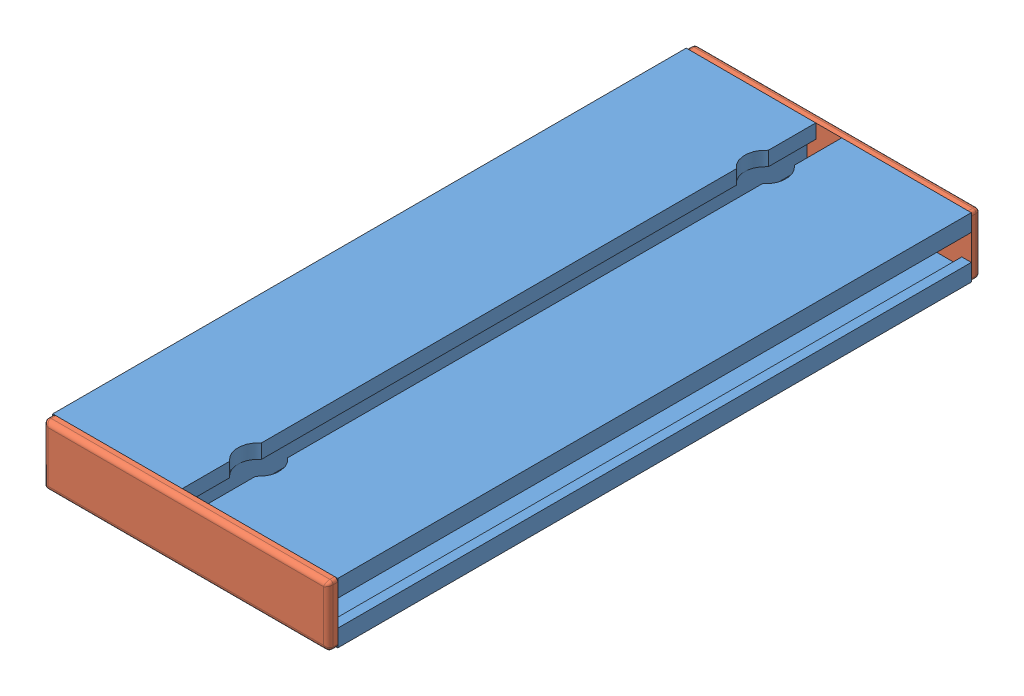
SolidWorks assembly 21.1733 FLOOR MOUNTING PLATE 90.SLDASM, configuration Default (file format 3800). Lengths in mm.
Overall size (90.01 19.01 206.01).
3 component instances, 2 part files, 6 mates.
Components (placement in the parent):
- 21.1733 FLOOR MOUNTING PLATE 90-1: 21.1733 FLOOR MOUNTING PLATE 90.SLDPRT [Default] at origin size (90 19 200)
- 22.1053_1 END CAP 90X19 GRAY-1: 22.1053_1 END CAP 90X19 GRAY.SLDPRT [Default] at (0 0 103) x (0 -1 0) z (0 0 -1) size (19.01 90.01 3)
- 22.1053_1 END CAP 90X19 GRAY-2: 22.1053_1 END CAP 90X19 GRAY.SLDPRT [Default] at (0 0 -103) x (0 1 0) z (0 0 1) size (19.01 90.01 3)
Mates (geometry in assembly coordinates):
- Coincident1: coincident: plane of ? through (-100.5791 0 100) normal (0 0 -1); plane of 21.1733 FLOOR MOUNTING PLATE 90-1 through (-18.4 -9.5 100) normal (0 0 1)
- Coincident2: coincident: plane of 21.1733 FLOOR MOUNTING PLATE 90-1 through (-4.1 9.5 -100) normal (0 1 0); plane of ? through (-55.5791 9.5 103) normal (0 1 0)
- Coincident3: coincident aligned: plane of 21.1733 FLOOR MOUNTING PLATE 90-1 through (45 4.1 -100) normal (1 0 0); plane of ? through (-55.5791 -9.5 103) normal (1 0 0)
- Coincident4: coincident: plane of 21.1733 FLOOR MOUNTING PLATE 90-1 through (-18.4 -9.5 -100) normal (0 0 -1); plane of ? through (68.5451 0 -100) normal (0 0 1)
- Coincident5: coincident: plane of ? through (23.5451 9.5 -103) normal (0 1 0); plane of 21.1733 FLOOR MOUNTING PLATE 90-1 through (45 9.5 -100) normal (0 1 0)
- Coincident6: coincident aligned: plane of 21.1733 FLOOR MOUNTING PLATE 90-1 through (-45 9.5 -100) normal (-1 0 0); plane of ? through (23.5451 -9.5 -103) normal (-1 0 0)
